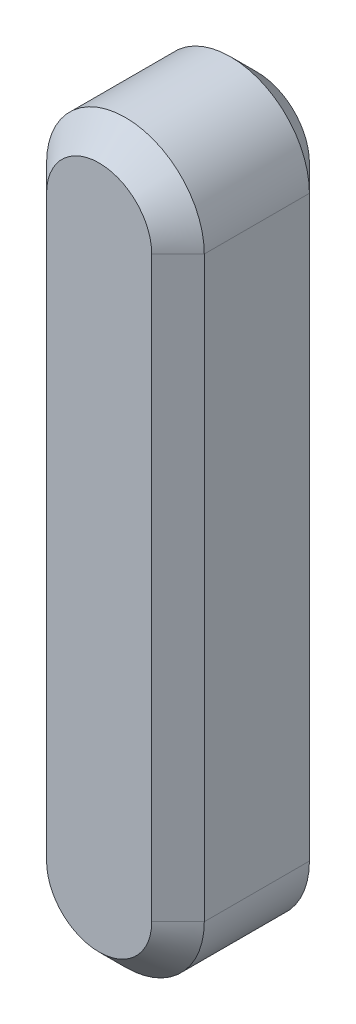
ISO-10303-21;
HEADER;
FILE_DESCRIPTION(('STEP AP214'),'2;1');
FILE_NAME('part.step','',(''),(''),'','','');
FILE_SCHEMA(('AUTOMOTIVE_DESIGN { 1 0 10303 214 1 1 1 1 }'));
ENDSEC;
DATA;
#1=APPLICATION_CONTEXT('core data for automotive mechanical design processes');
#2=APPLICATION_PROTOCOL_DEFINITION('international standard','automotive_design',2000,#1);
#3=PRODUCT_CONTEXT('',#1,'mechanical');
#4=PRODUCT('Part','Part','',(#3));
#5=PRODUCT_RELATED_PRODUCT_CATEGORY('part','',(#4));
#6=PRODUCT_DEFINITION_FORMATION('','',#4);
#7=PRODUCT_DEFINITION_CONTEXT('part definition',#1,'design');
#8=PRODUCT_DEFINITION('design','',#6,#7);
#9=PRODUCT_DEFINITION_SHAPE('','',#8);
#10=(LENGTH_UNIT() NAMED_UNIT(*) SI_UNIT(.MILLI.,.METRE.));
#11=(NAMED_UNIT(*) PLANE_ANGLE_UNIT() SI_UNIT($,.RADIAN.));
#12=(NAMED_UNIT(*) SI_UNIT($,.STERADIAN.) SOLID_ANGLE_UNIT());
#13=UNCERTAINTY_MEASURE_WITH_UNIT(LENGTH_MEASURE(1.E-05),#10,'distance_accuracy_value','');
#14=(GEOMETRIC_REPRESENTATION_CONTEXT(3) GLOBAL_UNCERTAINTY_ASSIGNED_CONTEXT((#13)) GLOBAL_UNIT_ASSIGNED_CONTEXT((#10,
#11,#12)) REPRESENTATION_CONTEXT('',''));
#15=CARTESIAN_POINT('',(0.,0.,0.));
#16=DIRECTION('',(0.,0.,1.));
#17=DIRECTION('',(1.,0.,0.));
#18=AXIS2_PLACEMENT_3D('',#15,#16,#17);
#19=CARTESIAN_POINT('',(0.,0.,3.));
#20=DIRECTION('',(0.,0.,-1.));
#21=DIRECTION('',(-1.,0.,0.));
#22=AXIS2_PLACEMENT_3D('',#19,#20,#21);
#23=CYLINDRICAL_SURFACE('',#22,1.5);
#24=DIRECTION('',(0.,0.,-1.));
#25=VECTOR('',#24,1.);
#26=CARTESIAN_POINT('',(1.5,0.,3.));
#27=LINE('',#26,#25);
#28=CARTESIAN_POINT('',(1.5,0.,2.5));
#29=VERTEX_POINT('',#28);
#30=CARTESIAN_POINT('',(1.5,0.,0.499999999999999));
#31=VERTEX_POINT('',#30);
#32=EDGE_CURVE('E103',#29,#31,#27,.T.);
#33=ORIENTED_EDGE('',*,*,#32,.T.);
#34=CARTESIAN_POINT('',(0.,0.,0.499999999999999));
#35=DIRECTION('',(0.,0.,1.));
#36=DIRECTION('',(1.,0.,0.));
#37=AXIS2_PLACEMENT_3D('',#34,#35,#36);
#38=CIRCLE('',#37,1.5);
#39=CARTESIAN_POINT('',(-1.5,0.,0.499999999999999));
#40=VERTEX_POINT('',#39);
#41=EDGE_CURVE('E180',#31,#40,#38,.T.);
#42=ORIENTED_EDGE('',*,*,#41,.T.);
#43=DIRECTION('',(0.,0.,-1.));
#44=VECTOR('',#43,1.);
#45=CARTESIAN_POINT('',(-1.5,0.,3.));
#46=LINE('',#45,#44);
#47=CARTESIAN_POINT('',(-1.5,0.,2.5));
#48=VERTEX_POINT('',#47);
#49=EDGE_CURVE('E130',#48,#40,#46,.T.);
#50=ORIENTED_EDGE('',*,*,#49,.F.);
#51=CARTESIAN_POINT('',(0.,0.,2.5));
#52=DIRECTION('',(0.,0.,1.));
#53=DIRECTION('',(1.,0.,0.));
#54=AXIS2_PLACEMENT_3D('',#51,#52,#53);
#55=CIRCLE('',#54,1.5);
#56=EDGE_CURVE('E178',#48,#29,#55,.F.);
#57=ORIENTED_EDGE('',*,*,#56,.T.);
#58=EDGE_LOOP('',(#33,#42,#50,#57));
#59=FACE_BOUND('',#58,.T.);
#60=ADVANCED_FACE('F32',(#59),#23,.T.);
#61=CARTESIAN_POINT('',(-1.5,0.,3.));
#62=DIRECTION('',(1.,0.,0.));
#63=DIRECTION('',(0.,1.,0.));
#64=AXIS2_PLACEMENT_3D('',#61,#62,#63);
#65=PLANE('',#64);
#66=ORIENTED_EDGE('',*,*,#49,.T.);
#67=DIRECTION('',(0.,-1.,0.));
#68=VECTOR('',#67,1.);
#69=CARTESIAN_POINT('',(-1.5,0.,0.499999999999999));
#70=LINE('',#69,#68);
#71=CARTESIAN_POINT('',(-1.5,-11.,0.499999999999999));
#72=VERTEX_POINT('',#71);
#73=EDGE_CURVE('E184',#40,#72,#70,.T.);
#74=ORIENTED_EDGE('',*,*,#73,.T.);
#75=DIRECTION('',(0.,0.,-1.));
#76=VECTOR('',#75,1.);
#77=CARTESIAN_POINT('',(-1.5,-11.,3.));
#78=LINE('',#77,#76);
#79=CARTESIAN_POINT('',(-1.5,-11.,2.5));
#80=VERTEX_POINT('',#79);
#81=EDGE_CURVE('E121',#80,#72,#78,.T.);
#82=ORIENTED_EDGE('',*,*,#81,.F.);
#83=DIRECTION('',(0.,1.,0.));
#84=VECTOR('',#83,1.);
#85=CARTESIAN_POINT('',(-1.5,0.,2.5));
#86=LINE('',#85,#84);
#87=EDGE_CURVE('E182',#80,#48,#86,.T.);
#88=ORIENTED_EDGE('',*,*,#87,.T.);
#89=EDGE_LOOP('',(#66,#74,#82,#88));
#90=FACE_BOUND('',#89,.T.);
#91=ADVANCED_FACE('F193',(#90),#65,.F.);
#92=CARTESIAN_POINT('',(0.,-11.,3.));
#93=DIRECTION('',(0.,0.,-1.));
#94=DIRECTION('',(-1.,0.,0.));
#95=AXIS2_PLACEMENT_3D('',#92,#93,#94);
#96=CYLINDRICAL_SURFACE('',#95,1.5);
#97=ORIENTED_EDGE('',*,*,#81,.T.);
#98=CARTESIAN_POINT('',(0.,-11.,0.499999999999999));
#99=DIRECTION('',(0.,0.,1.));
#100=DIRECTION('',(1.,0.,0.));
#101=AXIS2_PLACEMENT_3D('',#98,#99,#100);
#102=CIRCLE('',#101,1.5);
#103=CARTESIAN_POINT('',(1.5,-11.,0.499999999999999));
#104=VERTEX_POINT('',#103);
#105=EDGE_CURVE('E120',#72,#104,#102,.T.);
#106=ORIENTED_EDGE('',*,*,#105,.T.);
#107=DIRECTION('',(0.,0.,-1.));
#108=VECTOR('',#107,1.);
#109=CARTESIAN_POINT('',(1.5,-11.,3.));
#110=LINE('',#109,#108);
#111=CARTESIAN_POINT('',(1.5,-11.,2.5));
#112=VERTEX_POINT('',#111);
#113=EDGE_CURVE('E101',#112,#104,#110,.T.);
#114=ORIENTED_EDGE('',*,*,#113,.F.);
#115=CARTESIAN_POINT('',(0.,-11.,2.5));
#116=DIRECTION('',(0.,0.,1.));
#117=DIRECTION('',(1.,0.,0.));
#118=AXIS2_PLACEMENT_3D('',#115,#116,#117);
#119=CIRCLE('',#118,1.5);
#120=EDGE_CURVE('E117',#112,#80,#119,.F.);
#121=ORIENTED_EDGE('',*,*,#120,.T.);
#122=EDGE_LOOP('',(#97,#106,#114,#121));
#123=FACE_BOUND('',#122,.T.);
#124=ADVANCED_FACE('F116',(#123),#96,.T.);
#125=CARTESIAN_POINT('',(1.5,0.,3.));
#126=DIRECTION('',(-1.,0.,0.));
#127=DIRECTION('',(0.,-1.,0.));
#128=AXIS2_PLACEMENT_3D('',#125,#126,#127);
#129=PLANE('',#128);
#130=ORIENTED_EDGE('',*,*,#113,.T.);
#131=DIRECTION('',(0.,1.,0.));
#132=VECTOR('',#131,1.);
#133=CARTESIAN_POINT('',(1.5,0.,0.499999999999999));
#134=LINE('',#133,#132);
#135=EDGE_CURVE('E108',#104,#31,#134,.T.);
#136=ORIENTED_EDGE('',*,*,#135,.T.);
#137=ORIENTED_EDGE('',*,*,#32,.F.);
#138=DIRECTION('',(0.,-1.,0.));
#139=VECTOR('',#138,1.);
#140=CARTESIAN_POINT('',(1.5,-11.,2.5));
#141=LINE('',#140,#139);
#142=EDGE_CURVE('E98',#29,#112,#141,.T.);
#143=ORIENTED_EDGE('',*,*,#142,.T.);
#144=EDGE_LOOP('',(#130,#136,#137,#143));
#145=FACE_BOUND('',#144,.T.);
#146=ADVANCED_FACE('F100',(#145),#129,.F.);
#147=CARTESIAN_POINT('',(0.,0.,3.));
#148=DIRECTION('',(0.,0.,1.));
#149=DIRECTION('',(1.,0.,0.));
#150=AXIS2_PLACEMENT_3D('',#147,#148,#149);
#151=PLANE('',#150);
#152=DIRECTION('',(0.,-1.,0.));
#153=VECTOR('',#152,1.);
#154=CARTESIAN_POINT('',(-0.999999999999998,-11.,3.));
#155=LINE('',#154,#153);
#156=CARTESIAN_POINT('',(-1.,0.,3.));
#157=VERTEX_POINT('',#156);
#158=CARTESIAN_POINT('',(-0.999999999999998,-11.,3.));
#159=VERTEX_POINT('',#158);
#160=EDGE_CURVE('E41',#157,#159,#155,.T.);
#161=ORIENTED_EDGE('',*,*,#160,.T.);
#162=CARTESIAN_POINT('',(0.,-11.,3.));
#163=DIRECTION('',(0.,0.,1.));
#164=DIRECTION('',(1.,0.,0.));
#165=AXIS2_PLACEMENT_3D('',#162,#163,#164);
#166=CIRCLE('',#165,1.);
#167=CARTESIAN_POINT('',(1.,-11.,3.));
#168=VERTEX_POINT('',#167);
#169=EDGE_CURVE('E11',#159,#168,#166,.T.);
#170=ORIENTED_EDGE('',*,*,#169,.T.);
#171=DIRECTION('',(0.,1.,0.));
#172=VECTOR('',#171,1.);
#173=CARTESIAN_POINT('',(1.,0.,3.));
#174=LINE('',#173,#172);
#175=CARTESIAN_POINT('',(1.,0.,3.));
#176=VERTEX_POINT('',#175);
#177=EDGE_CURVE('E133',#168,#176,#174,.T.);
#178=ORIENTED_EDGE('',*,*,#177,.T.);
#179=CARTESIAN_POINT('',(0.,0.,3.));
#180=DIRECTION('',(0.,0.,1.));
#181=DIRECTION('',(1.,0.,0.));
#182=AXIS2_PLACEMENT_3D('',#179,#180,#181);
#183=CIRCLE('',#182,1.);
#184=EDGE_CURVE('E52',#176,#157,#183,.T.);
#185=ORIENTED_EDGE('',*,*,#184,.T.);
#186=EDGE_LOOP('',(#161,#170,#178,#185));
#187=FACE_BOUND('',#186,.T.);
#188=ADVANCED_FACE('F187',(#187),#151,.T.);
#189=CARTESIAN_POINT('',(0.,0.,0.));
#190=DIRECTION('',(0.,0.,1.));
#191=DIRECTION('',(1.,0.,0.));
#192=AXIS2_PLACEMENT_3D('',#189,#190,#191);
#193=PLANE('',#192);
#194=DIRECTION('',(0.,-1.,0.));
#195=VECTOR('',#194,1.);
#196=CARTESIAN_POINT('',(1.,0.,0.));
#197=LINE('',#196,#195);
#198=CARTESIAN_POINT('',(1.,0.,0.));
#199=VERTEX_POINT('',#198);
#200=CARTESIAN_POINT('',(1.,-11.,0.));
#201=VERTEX_POINT('',#200);
#202=EDGE_CURVE('E173',#199,#201,#197,.T.);
#203=ORIENTED_EDGE('',*,*,#202,.T.);
#204=CARTESIAN_POINT('',(0.,-11.,0.));
#205=DIRECTION('',(0.,0.,1.));
#206=DIRECTION('',(1.,0.,0.));
#207=AXIS2_PLACEMENT_3D('',#204,#205,#206);
#208=CIRCLE('',#207,1.);
#209=CARTESIAN_POINT('',(-0.999999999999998,-11.,0.));
#210=VERTEX_POINT('',#209);
#211=EDGE_CURVE('E109',#201,#210,#208,.F.);
#212=ORIENTED_EDGE('',*,*,#211,.T.);
#213=DIRECTION('',(0.,1.,0.));
#214=VECTOR('',#213,1.);
#215=CARTESIAN_POINT('',(-1.,0.,0.));
#216=LINE('',#215,#214);
#217=CARTESIAN_POINT('',(-1.,0.,0.));
#218=VERTEX_POINT('',#217);
#219=EDGE_CURVE('E169',#210,#218,#216,.T.);
#220=ORIENTED_EDGE('',*,*,#219,.T.);
#221=CARTESIAN_POINT('',(0.,0.,0.));
#222=DIRECTION('',(0.,0.,1.));
#223=DIRECTION('',(1.,0.,0.));
#224=AXIS2_PLACEMENT_3D('',#221,#222,#223);
#225=CIRCLE('',#224,1.);
#226=EDGE_CURVE('E171',#218,#199,#225,.F.);
#227=ORIENTED_EDGE('',*,*,#226,.T.);
#228=EDGE_LOOP('',(#203,#212,#220,#227));
#229=FACE_BOUND('',#228,.T.);
#230=ADVANCED_FACE('F219',(#229),#193,.F.);
#231=CARTESIAN_POINT('',(0.,0.,0.499999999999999));
#232=DIRECTION('',(0.,0.,1.));
#233=DIRECTION('',(1.,0.,0.));
#234=AXIS2_PLACEMENT_3D('',#231,#232,#233);
#235=CONICAL_SURFACE('',#234,1.5,0.78539816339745);
#236=DIRECTION('',(0.707106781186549,0.,0.707106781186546));
#237=VECTOR('',#236,1.);
#238=CARTESIAN_POINT('',(1.,0.,0.));
#239=LINE('',#238,#237);
#240=EDGE_CURVE('E149',#199,#31,#239,.T.);
#241=ORIENTED_EDGE('',*,*,#240,.F.);
#242=ORIENTED_EDGE('',*,*,#226,.F.);
#243=DIRECTION('',(0.707106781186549,0.,-0.707106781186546));
#244=VECTOR('',#243,1.);
#245=CARTESIAN_POINT('',(-1.5,0.,0.499999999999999));
#246=LINE('',#245,#244);
#247=EDGE_CURVE('E138',#40,#218,#246,.T.);
#248=ORIENTED_EDGE('',*,*,#247,.F.);
#249=ORIENTED_EDGE('',*,*,#41,.F.);
#250=EDGE_LOOP('',(#241,#242,#248,#249));
#251=FACE_BOUND('',#250,.T.);
#252=ADVANCED_FACE('F195',(#251),#235,.T.);
#253=CARTESIAN_POINT('',(-1.5,0.,0.499999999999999));
#254=DIRECTION('',(0.707106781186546,0.,0.707106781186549));
#255=DIRECTION('',(0.,-1.,0.));
#256=AXIS2_PLACEMENT_3D('',#253,#254,#255);
#257=PLANE('',#256);
#258=ORIENTED_EDGE('',*,*,#247,.T.);
#259=ORIENTED_EDGE('',*,*,#219,.F.);
#260=DIRECTION('',(0.707106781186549,0.,-0.707106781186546));
#261=VECTOR('',#260,1.);
#262=CARTESIAN_POINT('',(-1.5,-11.,0.499999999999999));
#263=LINE('',#262,#261);
#264=EDGE_CURVE('E143',#72,#210,#263,.T.);
#265=ORIENTED_EDGE('',*,*,#264,.F.);
#266=ORIENTED_EDGE('',*,*,#73,.F.);
#267=EDGE_LOOP('',(#258,#259,#265,#266));
#268=FACE_BOUND('',#267,.T.);
#269=ADVANCED_FACE('F198',(#268),#257,.F.);
#270=CARTESIAN_POINT('',(1.5,0.,0.499999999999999));
#271=DIRECTION('',(-0.707106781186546,0.,0.707106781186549));
#272=DIRECTION('',(0.,1.,0.));
#273=AXIS2_PLACEMENT_3D('',#270,#271,#272);
#274=PLANE('',#273);
#275=ORIENTED_EDGE('',*,*,#240,.T.);
#276=ORIENTED_EDGE('',*,*,#135,.F.);
#277=DIRECTION('',(0.707106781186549,0.,0.707106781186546));
#278=VECTOR('',#277,1.);
#279=CARTESIAN_POINT('',(1.,-11.,0.));
#280=LINE('',#279,#278);
#281=EDGE_CURVE('E141',#201,#104,#280,.T.);
#282=ORIENTED_EDGE('',*,*,#281,.F.);
#283=ORIENTED_EDGE('',*,*,#202,.F.);
#284=EDGE_LOOP('',(#275,#276,#282,#283));
#285=FACE_BOUND('',#284,.T.);
#286=ADVANCED_FACE('F201',(#285),#274,.F.);
#287=CARTESIAN_POINT('',(0.,-11.,0.499999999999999));
#288=DIRECTION('',(0.,0.,1.));
#289=DIRECTION('',(1.,0.,0.));
#290=AXIS2_PLACEMENT_3D('',#287,#288,#289);
#291=CONICAL_SURFACE('',#290,1.5,0.78539816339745);
#292=ORIENTED_EDGE('',*,*,#264,.T.);
#293=ORIENTED_EDGE('',*,*,#211,.F.);
#294=ORIENTED_EDGE('',*,*,#281,.T.);
#295=ORIENTED_EDGE('',*,*,#105,.F.);
#296=EDGE_LOOP('',(#292,#293,#294,#295));
#297=FACE_BOUND('',#296,.T.);
#298=ADVANCED_FACE('F199',(#297),#291,.T.);
#299=CARTESIAN_POINT('',(0.,0.,3.));
#300=DIRECTION('',(0.,0.,-1.));
#301=DIRECTION('',(-1.,0.,0.));
#302=AXIS2_PLACEMENT_3D('',#299,#300,#301);
#303=CONICAL_SURFACE('',#302,1.,0.785398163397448);
#304=DIRECTION('',(-0.707106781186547,0.,0.707106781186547));
#305=VECTOR('',#304,1.);
#306=CARTESIAN_POINT('',(1.5,0.,2.5));
#307=LINE('',#306,#305);
#308=EDGE_CURVE('E135',#29,#176,#307,.T.);
#309=ORIENTED_EDGE('',*,*,#308,.F.);
#310=ORIENTED_EDGE('',*,*,#56,.F.);
#311=DIRECTION('',(-0.707106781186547,0.,-0.707106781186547));
#312=VECTOR('',#311,1.);
#313=CARTESIAN_POINT('',(-1.,0.,3.));
#314=LINE('',#313,#312);
#315=EDGE_CURVE('E36',#157,#48,#314,.T.);
#316=ORIENTED_EDGE('',*,*,#315,.F.);
#317=ORIENTED_EDGE('',*,*,#184,.F.);
#318=EDGE_LOOP('',(#309,#310,#316,#317));
#319=FACE_BOUND('',#318,.T.);
#320=ADVANCED_FACE('F34',(#319),#303,.T.);
#321=CARTESIAN_POINT('',(-1.,0.,3.));
#322=DIRECTION('',(-0.707106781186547,0.,0.707106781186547));
#323=DIRECTION('',(0.,1.,0.));
#324=AXIS2_PLACEMENT_3D('',#321,#322,#323);
#325=PLANE('',#324);
#326=ORIENTED_EDGE('',*,*,#315,.T.);
#327=ORIENTED_EDGE('',*,*,#87,.F.);
#328=DIRECTION('',(-0.707106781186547,0.,-0.707106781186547));
#329=VECTOR('',#328,1.);
#330=CARTESIAN_POINT('',(-0.999999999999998,-11.,3.));
#331=LINE('',#330,#329);
#332=EDGE_CURVE('E128',#159,#80,#331,.T.);
#333=ORIENTED_EDGE('',*,*,#332,.F.);
#334=ORIENTED_EDGE('',*,*,#160,.F.);
#335=EDGE_LOOP('',(#326,#327,#333,#334));
#336=FACE_BOUND('',#335,.T.);
#337=ADVANCED_FACE('F190',(#336),#325,.T.);
#338=CARTESIAN_POINT('',(1.,0.,3.));
#339=DIRECTION('',(0.707106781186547,0.,0.707106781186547));
#340=DIRECTION('',(0.,-1.,0.));
#341=AXIS2_PLACEMENT_3D('',#338,#339,#340);
#342=PLANE('',#341);
#343=ORIENTED_EDGE('',*,*,#308,.T.);
#344=ORIENTED_EDGE('',*,*,#177,.F.);
#345=DIRECTION('',(-0.707106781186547,0.,0.707106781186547));
#346=VECTOR('',#345,1.);
#347=CARTESIAN_POINT('',(1.5,-11.,2.5));
#348=LINE('',#347,#346);
#349=EDGE_CURVE('E126',#112,#168,#348,.T.);
#350=ORIENTED_EDGE('',*,*,#349,.F.);
#351=ORIENTED_EDGE('',*,*,#142,.F.);
#352=EDGE_LOOP('',(#343,#344,#350,#351));
#353=FACE_BOUND('',#352,.T.);
#354=ADVANCED_FACE('F132',(#353),#342,.T.);
#355=CARTESIAN_POINT('',(0.,-11.,3.));
#356=DIRECTION('',(0.,0.,-1.));
#357=DIRECTION('',(-1.,0.,0.));
#358=AXIS2_PLACEMENT_3D('',#355,#356,#357);
#359=CONICAL_SURFACE('',#358,1.,0.785398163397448);
#360=ORIENTED_EDGE('',*,*,#332,.T.);
#361=ORIENTED_EDGE('',*,*,#120,.F.);
#362=ORIENTED_EDGE('',*,*,#349,.T.);
#363=ORIENTED_EDGE('',*,*,#169,.F.);
#364=EDGE_LOOP('',(#360,#361,#362,#363));
#365=FACE_BOUND('',#364,.T.);
#366=ADVANCED_FACE('F124',(#365),#359,.T.);
#367=CLOSED_SHELL('',(#60,#91,#124,#146,#188,#230,#252,#269,#286,#298,#320,#337,#354,#366));
#368=MANIFOLD_SOLID_BREP('B2',#367);
#369=ADVANCED_BREP_SHAPE_REPRESENTATION('',(#18,#368),#14);
#370=SHAPE_DEFINITION_REPRESENTATION(#9,#369);
ENDSEC;
END-ISO-10303-21;
